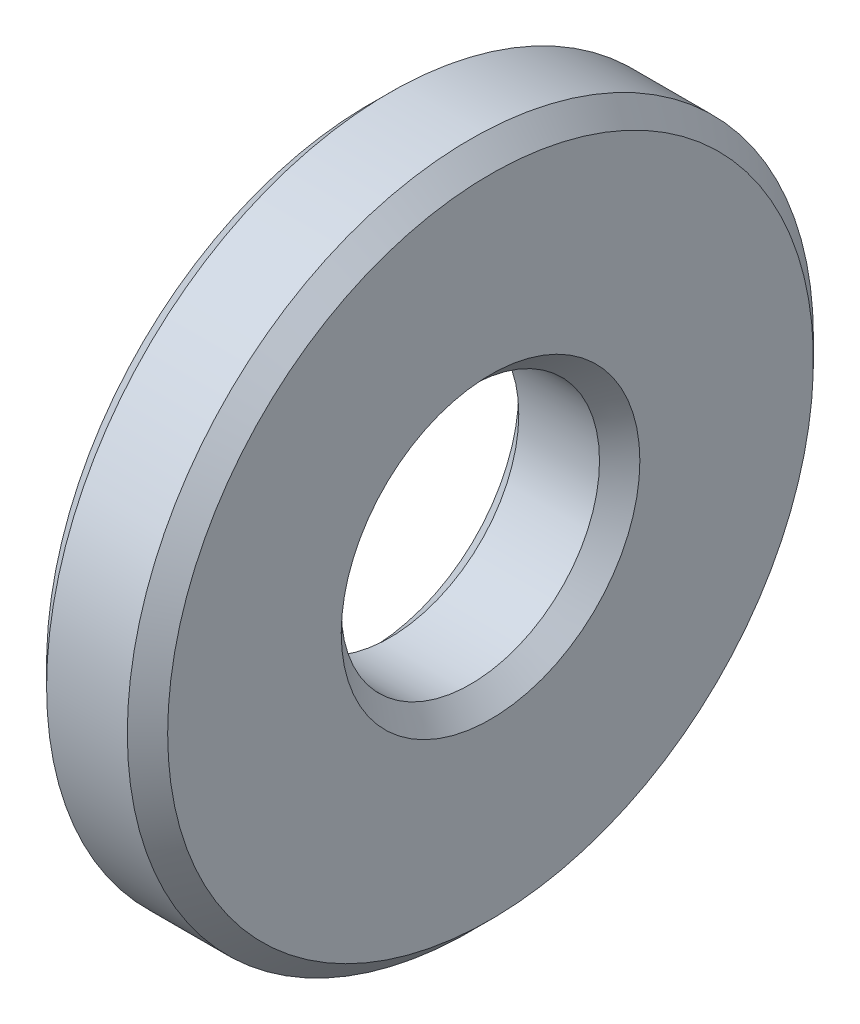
from build123d import *

# Parameters (mm, degrees)
ESQUISSE1_W     = 3
ESQUISSE1_H     = 5.3
CHANFREIN1_SIZE = 0.5


with BuildPart() as part:
    # Esquisse1 → Base-R_volution (revolve)
    with BuildSketch(Plane.XY, mode=Mode.PRIVATE) as base_r_volution_sk:
        with Locations((1.5, 5.85)):
            Rectangle(ESQUISSE1_W, ESQUISSE1_H)
    revolve(base_r_volution_sk.sketch.rotate(Axis((0, 0, 0), (1, 0, 0)), 90), axis=Axis((0, 0, 0), (1, 0, 0)))

    # Chanfrein1
    chanfrein1_edges = [part.edges().sort_by_distance(p)[0] for p in [
        (0, 0, -3.2),
        (3, 0, -3.2),
        (3, 0, -8.5),
        (0, 0, -8.5),
    ]]
    chamfer(chanfrein1_edges, length=CHANFREIN1_SIZE)


solid = part.part
